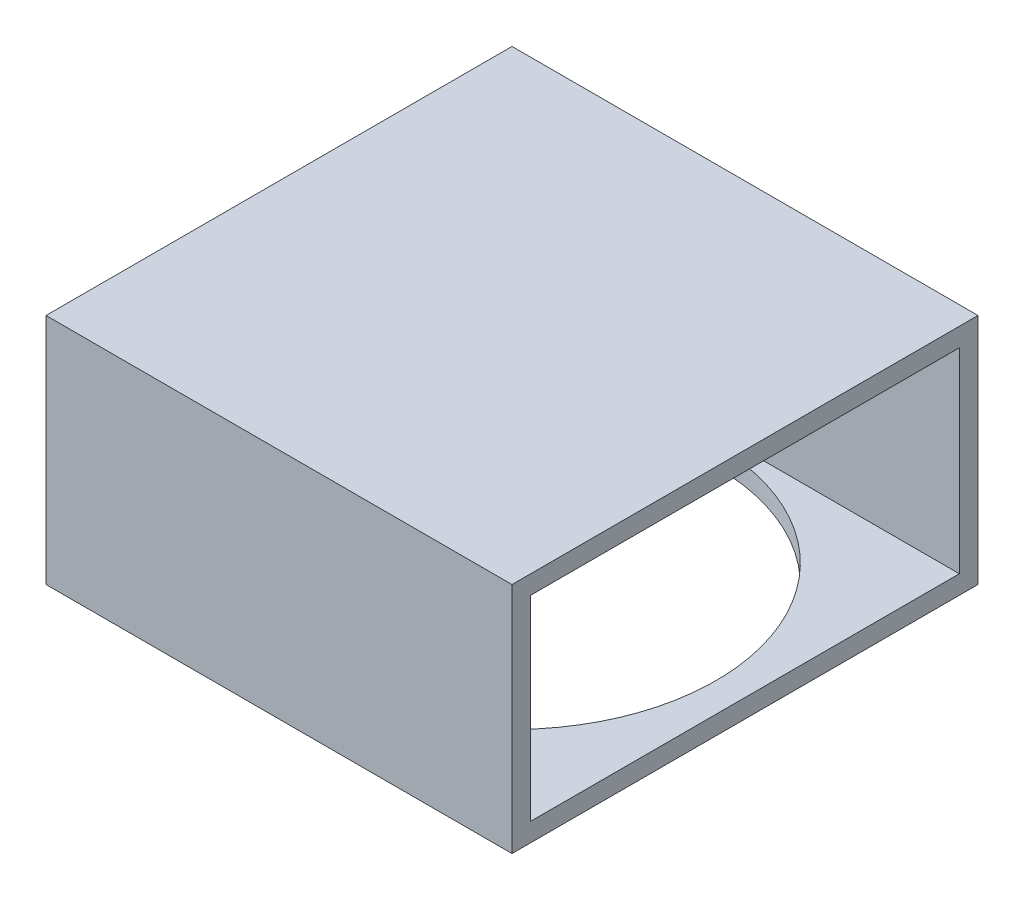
from build123d import *

# Parameters (mm, degrees)
SKETCH1_W           = 100
SKETCH1_H           = 50
SKETCH1_W_2         = 92
SKETCH1_H_2         = 42
BOSS_EXTRUDE1_DEPTH = 100
CUT_EXTRUDE1_REACH  = 152
SKETCH2_R           = 43.75


with BuildPart() as part:
    # Sketch1 → Boss-Extrude1 (new body)
    with BuildSketch(Plane(origin=(0, 0, 0), x_dir=(0, 0, -1), z_dir=(1, 0, 0))):
        with Locations((-50, -25)):
            Rectangle(SKETCH1_W, SKETCH1_H)
        with Locations((-50, -25)):
            Rectangle(SKETCH1_W_2, SKETCH1_H_2, mode=Mode.SUBTRACT)
    extrude(amount=BOSS_EXTRUDE1_DEPTH)

    # Sketch2 → Cut-Extrude1 (cut, up to next)
    with BuildSketch(Plane.XZ.offset(50), mode=Mode.PRIVATE) as cut_extrude1_sk1:
        with Locations(Location((50, 50, 0), (0, 0, 270))):
            Circle(SKETCH2_R)
    cut_extrude1_tool1 = extrude(cut_extrude1_sk1.sketch, amount=-CUT_EXTRUDE1_REACH, mode=Mode.PRIVATE) & part.part
    add(cut_extrude1_tool1.solids().sort_by_distance((50, -50, 50))[0], mode=Mode.SUBTRACT)


solid = part.part
